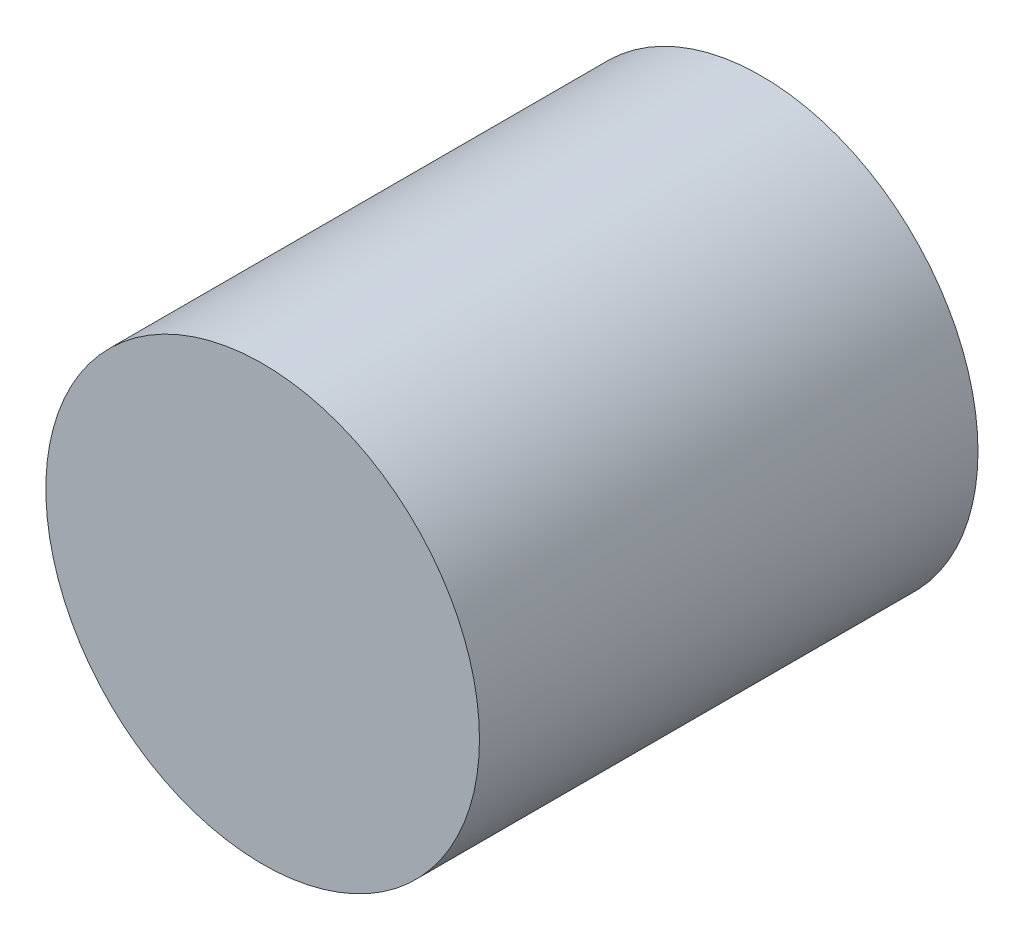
ISO-10303-21;
HEADER;
FILE_DESCRIPTION(('STEP AP214'),'2;1');
FILE_NAME('part.step','',(''),(''),'','','');
FILE_SCHEMA(('AUTOMOTIVE_DESIGN { 1 0 10303 214 1 1 1 1 }'));
ENDSEC;
DATA;
#1=APPLICATION_CONTEXT('core data for automotive mechanical design processes');
#2=APPLICATION_PROTOCOL_DEFINITION('international standard','automotive_design',2000,#1);
#3=PRODUCT_CONTEXT('',#1,'mechanical');
#4=PRODUCT('Part','Part','',(#3));
#5=PRODUCT_RELATED_PRODUCT_CATEGORY('part','',(#4));
#6=PRODUCT_DEFINITION_FORMATION('','',#4);
#7=PRODUCT_DEFINITION_CONTEXT('part definition',#1,'design');
#8=PRODUCT_DEFINITION('design','',#6,#7);
#9=PRODUCT_DEFINITION_SHAPE('','',#8);
#10=(LENGTH_UNIT() NAMED_UNIT(*) SI_UNIT(.MILLI.,.METRE.));
#11=(NAMED_UNIT(*) PLANE_ANGLE_UNIT() SI_UNIT($,.RADIAN.));
#12=(NAMED_UNIT(*) SI_UNIT($,.STERADIAN.) SOLID_ANGLE_UNIT());
#13=UNCERTAINTY_MEASURE_WITH_UNIT(LENGTH_MEASURE(1.E-05),#10,'distance_accuracy_value','');
#14=(GEOMETRIC_REPRESENTATION_CONTEXT(3) GLOBAL_UNCERTAINTY_ASSIGNED_CONTEXT((#13)) GLOBAL_UNIT_ASSIGNED_CONTEXT((#10,
#11,#12)) REPRESENTATION_CONTEXT('',''));
#15=CARTESIAN_POINT('',(0.,0.,0.));
#16=DIRECTION('',(0.,0.,1.));
#17=DIRECTION('',(1.,0.,0.));
#18=AXIS2_PLACEMENT_3D('',#15,#16,#17);
#19=CARTESIAN_POINT('',(38.9999464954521,24.0377028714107,34.29));
#20=DIRECTION('',(0.,0.,-1.));
#21=DIRECTION('',(-1.,0.,0.));
#22=AXIS2_PLACEMENT_3D('',#19,#20,#21);
#23=CYLINDRICAL_SURFACE('',#22,14.9124003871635);
#24=CARTESIAN_POINT('',(38.9999464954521,24.0377028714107,34.29));
#25=DIRECTION('',(0.,0.,1.));
#26=DIRECTION('',(1.,0.,0.));
#27=AXIS2_PLACEMENT_3D('',#24,#25,#26);
#28=CIRCLE('',#27,14.9124003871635);
#29=CARTESIAN_POINT('',(53.9123468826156,24.0377028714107,34.29));
#30=VERTEX_POINT('',#29);
#31=EDGE_CURVE('E10',#30,#30,#28,.T.);
#32=ORIENTED_EDGE('',*,*,#31,.F.);
#33=EDGE_LOOP('',(#32));
#34=FACE_BOUND('',#33,.T.);
#35=CARTESIAN_POINT('',(38.9999464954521,24.0377028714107,0.));
#36=DIRECTION('',(0.,0.,1.));
#37=DIRECTION('',(1.,0.,0.));
#38=AXIS2_PLACEMENT_3D('',#35,#36,#37);
#39=CIRCLE('',#38,14.9124003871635);
#40=CARTESIAN_POINT('',(53.9123468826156,24.0377028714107,0.));
#41=VERTEX_POINT('',#40);
#42=EDGE_CURVE('E30',#41,#41,#39,.T.);
#43=ORIENTED_EDGE('',*,*,#42,.T.);
#44=EDGE_LOOP('',(#43));
#45=FACE_BOUND('',#44,.T.);
#46=ADVANCED_FACE('F24',(#34,#45),#23,.T.);
#47=CARTESIAN_POINT('',(38.9999464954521,24.0377028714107,34.29));
#48=DIRECTION('',(0.,0.,1.));
#49=DIRECTION('',(1.,0.,0.));
#50=AXIS2_PLACEMENT_3D('',#47,#48,#49);
#51=PLANE('',#50);
#52=ORIENTED_EDGE('',*,*,#31,.T.);
#53=EDGE_LOOP('',(#52));
#54=FACE_BOUND('',#53,.T.);
#55=ADVANCED_FACE('F39',(#54),#51,.T.);
#56=CARTESIAN_POINT('',(38.9999464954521,24.0377028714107,0.));
#57=DIRECTION('',(0.,0.,1.));
#58=DIRECTION('',(1.,0.,0.));
#59=AXIS2_PLACEMENT_3D('',#56,#57,#58);
#60=PLANE('',#59);
#61=ORIENTED_EDGE('',*,*,#42,.F.);
#62=EDGE_LOOP('',(#61));
#63=FACE_BOUND('',#62,.T.);
#64=ADVANCED_FACE('F37',(#63),#60,.F.);
#65=CLOSED_SHELL('',(#46,#55,#64));
#66=MANIFOLD_SOLID_BREP('B2',#65);
#67=ADVANCED_BREP_SHAPE_REPRESENTATION('',(#18,#66),#14);
#68=SHAPE_DEFINITION_REPRESENTATION(#9,#67);
ENDSEC;
END-ISO-10303-21;
